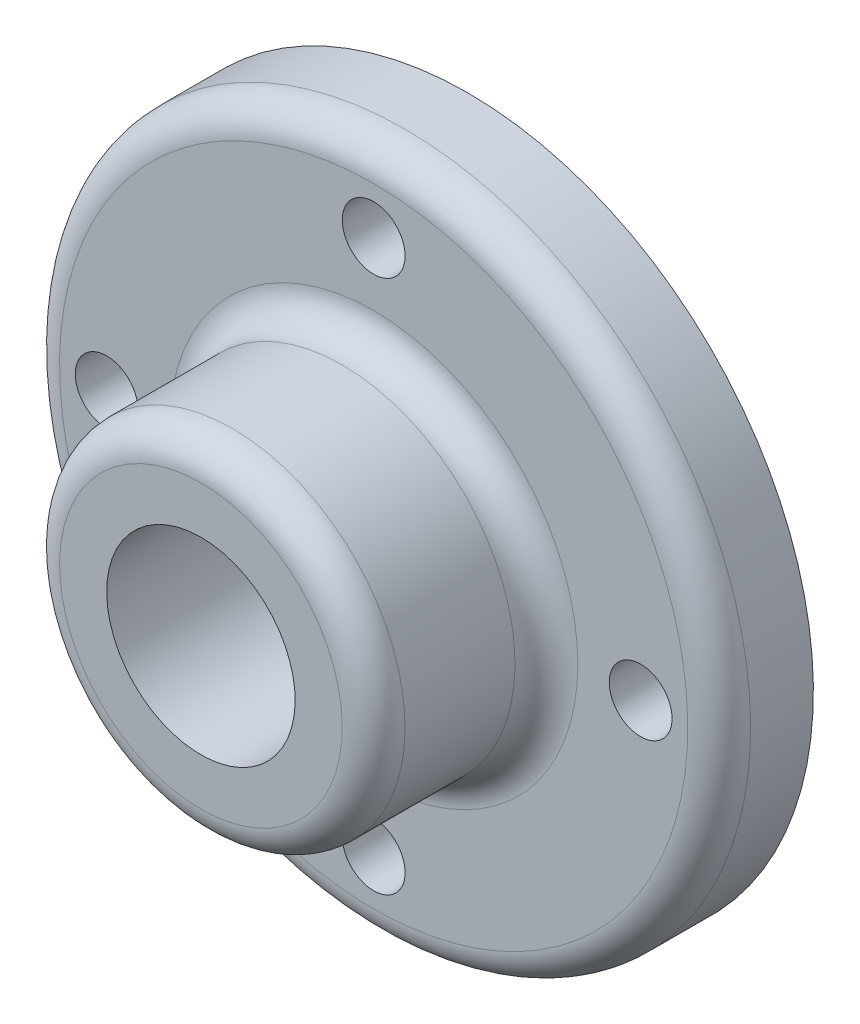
ISO-10303-21;
HEADER;
FILE_DESCRIPTION(('STEP AP214'),'2;1');
FILE_NAME('part.step','',(''),(''),'','','');
FILE_SCHEMA(('AUTOMOTIVE_DESIGN { 1 0 10303 214 1 1 1 1 }'));
ENDSEC;
DATA;
#1=APPLICATION_CONTEXT('core data for automotive mechanical design processes');
#2=APPLICATION_PROTOCOL_DEFINITION('international standard','automotive_design',2000,#1);
#3=PRODUCT_CONTEXT('',#1,'mechanical');
#4=PRODUCT('Part','Part','',(#3));
#5=PRODUCT_RELATED_PRODUCT_CATEGORY('part','',(#4));
#6=PRODUCT_DEFINITION_FORMATION('','',#4);
#7=PRODUCT_DEFINITION_CONTEXT('part definition',#1,'design');
#8=PRODUCT_DEFINITION('design','',#6,#7);
#9=PRODUCT_DEFINITION_SHAPE('','',#8);
#10=(LENGTH_UNIT() NAMED_UNIT(*) SI_UNIT(.MILLI.,.METRE.));
#11=(NAMED_UNIT(*) PLANE_ANGLE_UNIT() SI_UNIT($,.RADIAN.));
#12=(NAMED_UNIT(*) SI_UNIT($,.STERADIAN.) SOLID_ANGLE_UNIT());
#13=UNCERTAINTY_MEASURE_WITH_UNIT(LENGTH_MEASURE(1.E-05),#10,'distance_accuracy_value','');
#14=(GEOMETRIC_REPRESENTATION_CONTEXT(3) GLOBAL_UNCERTAINTY_ASSIGNED_CONTEXT((#13)) GLOBAL_UNIT_ASSIGNED_CONTEXT((#10,
#11,#12)) REPRESENTATION_CONTEXT('',''));
#15=CARTESIAN_POINT('',(0.,0.,0.));
#16=DIRECTION('',(0.,0.,1.));
#17=DIRECTION('',(1.,0.,0.));
#18=AXIS2_PLACEMENT_3D('',#15,#16,#17);
#19=CARTESIAN_POINT('',(0.,-19.05,-1.33025516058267E-13));
#20=DIRECTION('',(0.,0.,1.));
#21=DIRECTION('',(0.,-1.,0.));
#22=AXIS2_PLACEMENT_3D('',#19,#20,#21);
#23=PLANE('',#22);
#24=CARTESIAN_POINT('',(5.65362541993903E-13,-53.975,-1.84227633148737E-12));
#25=DIRECTION('',(0.,0.,1.));
#26=DIRECTION('',(0.,-1.,0.));
#27=AXIS2_PLACEMENT_3D('',#24,#25,#26);
#28=CIRCLE('',#27,6.35);
#29=CARTESIAN_POINT('',(6.31875261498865E-13,-60.325,-1.88661817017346E-12));
#30=VERTEX_POINT('',#29);
#31=EDGE_CURVE('E79',#30,#30,#28,.T.);
#32=ORIENTED_EDGE('',*,*,#31,.T.);
#33=EDGE_LOOP('',(#32));
#34=FACE_BOUND('',#33,.T.);
#35=CARTESIAN_POINT('',(-53.975,-3.76909836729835E-13,-1.46410661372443E-12));
#36=DIRECTION('',(0.,0.,1.));
#37=DIRECTION('',(-1.,0.,0.));
#38=AXIS2_PLACEMENT_3D('',#35,#36,#37);
#39=CIRCLE('',#38,6.35);
#40=CARTESIAN_POINT('',(-60.325,-4.21251649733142E-13,-1.46410661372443E-12));
#41=VERTEX_POINT('',#40);
#42=EDGE_CURVE('E73',#41,#41,#39,.T.);
#43=ORIENTED_EDGE('',*,*,#42,.T.);
#44=EDGE_LOOP('',(#43));
#45=FACE_BOUND('',#44,.T.);
#46=CARTESIAN_POINT('',(-1.88457131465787E-13,53.975,-1.08940634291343E-12));
#47=DIRECTION('',(0.,0.,1.));
#48=DIRECTION('',(0.,1.,0.));
#49=AXIS2_PLACEMENT_3D('',#46,#47,#48);
#50=CIRCLE('',#49,6.35);
#51=CARTESIAN_POINT('',(-2.10628037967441E-13,60.325,-1.04506450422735E-12));
#52=VERTEX_POINT('',#51);
#53=EDGE_CURVE('E67',#52,#52,#50,.T.);
#54=ORIENTED_EDGE('',*,*,#53,.T.);
#55=EDGE_LOOP('',(#54));
#56=FACE_BOUND('',#55,.T.);
#57=CARTESIAN_POINT('',(53.975,0.,-4.8919202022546E-13));
#58=DIRECTION('',(0.,0.,1.));
#59=DIRECTION('',(1.,0.,0.));
#60=AXIS2_PLACEMENT_3D('',#57,#58,#59);
#61=CIRCLE('',#60,6.35);
#62=CARTESIAN_POINT('',(60.325,0.,-4.8919202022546E-13));
#63=VERTEX_POINT('',#62);
#64=EDGE_CURVE('E63',#63,#63,#61,.T.);
#65=ORIENTED_EDGE('',*,*,#64,.T.);
#66=EDGE_LOOP('',(#65));
#67=FACE_BOUND('',#66,.T.);
#68=CARTESIAN_POINT('',(0.,0.,0.));
#69=DIRECTION('',(0.,0.,-1.));
#70=DIRECTION('',(0.,1.,0.));
#71=AXIS2_PLACEMENT_3D('',#68,#69,#70);
#72=CIRCLE('',#71,19.05);
#73=CARTESIAN_POINT('',(0.,19.05,1.33025516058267E-13));
#74=VERTEX_POINT('',#73);
#75=EDGE_CURVE('E10',#74,#74,#72,.T.);
#76=ORIENTED_EDGE('',*,*,#75,.F.);
#77=EDGE_LOOP('',(#76));
#78=FACE_BOUND('',#77,.T.);
#79=CARTESIAN_POINT('',(0.,0.,0.));
#80=DIRECTION('',(0.,0.,-1.));
#81=DIRECTION('',(0.,1.,0.));
#82=AXIS2_PLACEMENT_3D('',#79,#80,#81);
#83=CIRCLE('',#82,69.85);
#84=CARTESIAN_POINT('',(0.,69.85,4.87760225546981E-13));
#85=VERTEX_POINT('',#84);
#86=EDGE_CURVE('E60',#85,#85,#83,.T.);
#87=ORIENTED_EDGE('',*,*,#86,.T.);
#88=EDGE_LOOP('',(#87));
#89=FACE_BOUND('',#88,.T.);
#90=ADVANCED_FACE('F29',(#34,#45,#56,#67,#78,#89),#23,.F.);
#91=CARTESIAN_POINT('',(0.,0.,0.));
#92=DIRECTION('',(0.,0.,-1.));
#93=DIRECTION('',(0.,1.,0.));
#94=AXIS2_PLACEMENT_3D('',#91,#92,#93);
#95=CYLINDRICAL_SURFACE('',#94,19.05);
#96=CARTESIAN_POINT('',(0.,-3.76905628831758E-13,53.975));
#97=DIRECTION('',(0.,0.,-1.));
#98=DIRECTION('',(0.,1.,0.));
#99=AXIS2_PLACEMENT_3D('',#96,#97,#98);
#100=CIRCLE('',#99,19.05);
#101=CARTESIAN_POINT('',(0.,19.0499999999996,53.9750000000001));
#102=VERTEX_POINT('',#101);
#103=EDGE_CURVE('E35',#102,#102,#100,.T.);
#104=ORIENTED_EDGE('',*,*,#103,.F.);
#105=EDGE_LOOP('',(#104));
#106=FACE_BOUND('',#105,.T.);
#107=ORIENTED_EDGE('',*,*,#75,.T.);
#108=EDGE_LOOP('',(#107));
#109=FACE_BOUND('',#108,.T.);
#110=ADVANCED_FACE('F132',(#106,#109),#95,.F.);
#111=CARTESIAN_POINT('',(0.,-28.5750000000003,53.9749999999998));
#112=DIRECTION('',(0.,0.,-1.));
#113=DIRECTION('',(0.,1.,0.));
#114=AXIS2_PLACEMENT_3D('',#111,#112,#113);
#115=PLANE('',#114);
#116=CARTESIAN_POINT('',(0.,-3.76905628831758E-13,53.975));
#117=DIRECTION('',(0.,0.,-1.));
#118=DIRECTION('',(0.,1.,0.));
#119=AXIS2_PLACEMENT_3D('',#116,#117,#118);
#120=CIRCLE('',#119,28.575);
#121=CARTESIAN_POINT('',(0.,28.5749999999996,53.9750000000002));
#122=VERTEX_POINT('',#121);
#123=EDGE_CURVE('E39',#122,#122,#120,.T.);
#124=ORIENTED_EDGE('',*,*,#123,.F.);
#125=EDGE_LOOP('',(#124));
#126=FACE_BOUND('',#125,.T.);
#127=ORIENTED_EDGE('',*,*,#103,.T.);
#128=EDGE_LOOP('',(#127));
#129=FACE_BOUND('',#128,.T.);
#130=ADVANCED_FACE('F127',(#126,#129),#115,.F.);
#131=CARTESIAN_POINT('',(0.,-3.33066907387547E-13,47.625));
#132=DIRECTION('',(0.,0.,-1.));
#133=DIRECTION('',(0.,1.,0.));
#134=AXIS2_PLACEMENT_3D('',#131,#132,#133);
#135=TOROIDAL_SURFACE('',#134,28.575,6.35);
#136=CARTESIAN_POINT('',(0.,-3.32563790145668E-13,47.625));
#137=DIRECTION('',(0.,0.,-1.));
#138=DIRECTION('',(0.,1.,0.));
#139=AXIS2_PLACEMENT_3D('',#136,#137,#138);
#140=CIRCLE('',#139,34.925);
#141=CARTESIAN_POINT('',(0.,34.9249999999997,47.6250000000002));
#142=VERTEX_POINT('',#141);
#143=EDGE_CURVE('E43',#142,#142,#140,.T.);
#144=ORIENTED_EDGE('',*,*,#143,.F.);
#145=EDGE_LOOP('',(#144));
#146=FACE_BOUND('',#145,.T.);
#147=ORIENTED_EDGE('',*,*,#123,.T.);
#148=EDGE_LOOP('',(#147));
#149=FACE_BOUND('',#148,.T.);
#150=ADVANCED_FACE('F121',(#146,#149),#135,.T.);
#151=CARTESIAN_POINT('',(0.,0.,0.));
#152=DIRECTION('',(0.,0.,-1.));
#153=DIRECTION('',(0.,1.,0.));
#154=AXIS2_PLACEMENT_3D('',#151,#152,#153);
#155=CYLINDRICAL_SURFACE('',#154,34.925);
#156=CARTESIAN_POINT('',(0.,-1.77367354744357E-13,25.4));
#157=DIRECTION('',(0.,0.,-1.));
#158=DIRECTION('',(0.,1.,0.));
#159=AXIS2_PLACEMENT_3D('',#156,#157,#158);
#160=CIRCLE('',#159,34.925);
#161=CARTESIAN_POINT('',(0.,34.9249999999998,25.4000000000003));
#162=VERTEX_POINT('',#161);
#163=EDGE_CURVE('E48',#162,#162,#160,.T.);
#164=ORIENTED_EDGE('',*,*,#163,.F.);
#165=EDGE_LOOP('',(#164));
#166=FACE_BOUND('',#165,.T.);
#167=ORIENTED_EDGE('',*,*,#143,.T.);
#168=EDGE_LOOP('',(#167));
#169=FACE_BOUND('',#168,.T.);
#170=ADVANCED_FACE('F115',(#166,#169),#155,.T.);
#171=CARTESIAN_POINT('',(0.,-1.80411241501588E-13,25.4));
#172=DIRECTION('',(0.,0.,-1.));
#173=DIRECTION('',(0.,1.,0.));
#174=AXIS2_PLACEMENT_3D('',#171,#172,#173);
#175=TOROIDAL_SURFACE('',#174,41.275,6.35);
#176=CARTESIAN_POINT('',(0.,-1.33025516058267E-13,19.05));
#177=DIRECTION('',(0.,0.,-1.));
#178=DIRECTION('',(0.,1.,0.));
#179=AXIS2_PLACEMENT_3D('',#176,#177,#178);
#180=CIRCLE('',#179,41.275);
#181=CARTESIAN_POINT('',(0.,41.2749999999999,19.0500000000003));
#182=VERTEX_POINT('',#181);
#183=EDGE_CURVE('E51',#182,#182,#180,.T.);
#184=ORIENTED_EDGE('',*,*,#183,.F.);
#185=EDGE_LOOP('',(#184));
#186=FACE_BOUND('',#185,.T.);
#187=ORIENTED_EDGE('',*,*,#163,.T.);
#188=EDGE_LOOP('',(#187));
#189=FACE_BOUND('',#188,.T.);
#190=ADVANCED_FACE('F101',(#186,#189),#175,.F.);
#191=CARTESIAN_POINT('',(0.,-63.5000000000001,19.0499999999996));
#192=DIRECTION('',(0.,0.,-1.));
#193=DIRECTION('',(0.,1.,0.));
#194=AXIS2_PLACEMENT_3D('',#191,#192,#193);
#195=PLANE('',#194);
#196=CARTESIAN_POINT('',(6.98388058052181E-13,-53.9750000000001,19.0499999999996));
#197=DIRECTION('',(0.,0.,1.));
#198=DIRECTION('',(0.,-1.,0.));
#199=AXIS2_PLACEMENT_3D('',#196,#197,#198);
#200=CIRCLE('',#199,6.35);
#201=CARTESIAN_POINT('',(7.64900777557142E-13,-60.3250000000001,19.0499999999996));
#202=VERTEX_POINT('',#201);
#203=EDGE_CURVE('E82',#202,#202,#200,.T.);
#204=ORIENTED_EDGE('',*,*,#203,.F.);
#205=EDGE_LOOP('',(#204));
#206=FACE_BOUND('',#205,.T.);
#207=CARTESIAN_POINT('',(-53.975,-6.4296086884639E-13,19.05));
#208=DIRECTION('',(0.,0.,1.));
#209=DIRECTION('',(-1.,0.,0.));
#210=AXIS2_PLACEMENT_3D('',#207,#208,#209);
#211=CIRCLE('',#210,6.35);
#212=CARTESIAN_POINT('',(-60.325,-6.87302681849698E-13,19.05));
#213=VERTEX_POINT('',#212);
#214=EDGE_CURVE('E76',#213,#213,#211,.T.);
#215=ORIENTED_EDGE('',*,*,#214,.F.);
#216=EDGE_LOOP('',(#215));
#217=FACE_BOUND('',#216,.T.);
#218=CARTESIAN_POINT('',(-3.21482647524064E-13,53.9749999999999,19.0500000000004));
#219=DIRECTION('',(0.,0.,1.));
#220=DIRECTION('',(0.,1.,0.));
#221=AXIS2_PLACEMENT_3D('',#218,#219,#220);
#222=CIRCLE('',#221,6.35);
#223=CARTESIAN_POINT('',(-3.43653554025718E-13,60.3249999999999,19.0500000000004));
#224=VERTEX_POINT('',#223);
#225=EDGE_CURVE('E70',#224,#224,#222,.T.);
#226=ORIENTED_EDGE('',*,*,#225,.F.);
#227=EDGE_LOOP('',(#226));
#228=FACE_BOUND('',#227,.T.);
#229=CARTESIAN_POINT('',(53.975,0.,19.05));
#230=DIRECTION('',(0.,0.,1.));
#231=DIRECTION('',(1.,0.,0.));
#232=AXIS2_PLACEMENT_3D('',#229,#230,#231);
#233=CIRCLE('',#232,6.35);
#234=CARTESIAN_POINT('',(60.325,0.,19.05));
#235=VERTEX_POINT('',#234);
#236=EDGE_CURVE('E64',#235,#235,#233,.T.);
#237=ORIENTED_EDGE('',*,*,#236,.F.);
#238=EDGE_LOOP('',(#237));
#239=FACE_BOUND('',#238,.T.);
#240=CARTESIAN_POINT('',(0.,-1.33025516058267E-13,19.05));
#241=DIRECTION('',(0.,0.,-1.));
#242=DIRECTION('',(0.,1.,0.));
#243=AXIS2_PLACEMENT_3D('',#240,#241,#242);
#244=CIRCLE('',#243,63.4999999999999);
#245=CARTESIAN_POINT('',(0.,63.4999999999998,19.0500000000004));
#246=VERTEX_POINT('',#245);
#247=EDGE_CURVE('E54',#246,#246,#244,.T.);
#248=ORIENTED_EDGE('',*,*,#247,.F.);
#249=EDGE_LOOP('',(#248));
#250=FACE_BOUND('',#249,.T.);
#251=ORIENTED_EDGE('',*,*,#183,.T.);
#252=EDGE_LOOP('',(#251));
#253=FACE_BOUND('',#252,.T.);
#254=ADVANCED_FACE('F97',(#206,#217,#228,#239,#250,#253),#195,.F.);
#255=CARTESIAN_POINT('',(0.,0.,12.7));
#256=DIRECTION('',(0.,0.,-1.));
#257=DIRECTION('',(0.,1.,0.));
#258=AXIS2_PLACEMENT_3D('',#255,#256,#257);
#259=TOROIDAL_SURFACE('',#258,63.5,6.35);
#260=CARTESIAN_POINT('',(0.,0.,12.7));
#261=DIRECTION('',(0.,0.,-1.));
#262=DIRECTION('',(0.,1.,0.));
#263=AXIS2_PLACEMENT_3D('',#260,#261,#262);
#264=CIRCLE('',#263,69.85);
#265=CARTESIAN_POINT('',(0.,69.8499999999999,12.7000000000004));
#266=VERTEX_POINT('',#265);
#267=EDGE_CURVE('E57',#266,#266,#264,.T.);
#268=ORIENTED_EDGE('',*,*,#267,.F.);
#269=EDGE_LOOP('',(#268));
#270=FACE_BOUND('',#269,.T.);
#271=ORIENTED_EDGE('',*,*,#247,.T.);
#272=EDGE_LOOP('',(#271));
#273=FACE_BOUND('',#272,.T.);
#274=ADVANCED_FACE('F100',(#270,#273),#259,.T.);
#275=CARTESIAN_POINT('',(0.,0.,0.));
#276=DIRECTION('',(0.,0.,-1.));
#277=DIRECTION('',(0.,1.,0.));
#278=AXIS2_PLACEMENT_3D('',#275,#276,#277);
#279=CYLINDRICAL_SURFACE('',#278,69.85);
#280=ORIENTED_EDGE('',*,*,#86,.F.);
#281=EDGE_LOOP('',(#280));
#282=FACE_BOUND('',#281,.T.);
#283=ORIENTED_EDGE('',*,*,#267,.T.);
#284=EDGE_LOOP('',(#283));
#285=FACE_BOUND('',#284,.T.);
#286=ADVANCED_FACE('F179',(#282,#285),#279,.T.);
#287=CARTESIAN_POINT('',(53.975,0.,-4.8919202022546E-13));
#288=DIRECTION('',(0.,0.,1.));
#289=DIRECTION('',(1.,0.,0.));
#290=AXIS2_PLACEMENT_3D('',#287,#288,#289);
#291=CYLINDRICAL_SURFACE('',#290,6.35);
#292=ORIENTED_EDGE('',*,*,#64,.F.);
#293=EDGE_LOOP('',(#292));
#294=FACE_BOUND('',#293,.T.);
#295=ORIENTED_EDGE('',*,*,#236,.T.);
#296=EDGE_LOOP('',(#295));
#297=FACE_BOUND('',#296,.T.);
#298=ADVANCED_FACE('F188',(#294,#297),#291,.F.);
#299=CARTESIAN_POINT('',(-1.88457131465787E-13,53.975,-1.08940634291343E-12));
#300=DIRECTION('',(0.,0.,1.));
#301=DIRECTION('',(0.,-1.,0.));
#302=AXIS2_PLACEMENT_3D('',#299,#300,#301);
#303=CYLINDRICAL_SURFACE('',#302,6.35);
#304=ORIENTED_EDGE('',*,*,#53,.F.);
#305=EDGE_LOOP('',(#304));
#306=FACE_BOUND('',#305,.T.);
#307=ORIENTED_EDGE('',*,*,#225,.T.);
#308=EDGE_LOOP('',(#307));
#309=FACE_BOUND('',#308,.T.);
#310=ADVANCED_FACE('F197',(#306,#309),#303,.F.);
#311=CARTESIAN_POINT('',(-53.975,-3.76909836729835E-13,-1.46410661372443E-12));
#312=DIRECTION('',(0.,0.,1.));
#313=DIRECTION('',(0.,-1.,0.));
#314=AXIS2_PLACEMENT_3D('',#311,#312,#313);
#315=CYLINDRICAL_SURFACE('',#314,6.35);
#316=ORIENTED_EDGE('',*,*,#42,.F.);
#317=EDGE_LOOP('',(#316));
#318=FACE_BOUND('',#317,.T.);
#319=ORIENTED_EDGE('',*,*,#214,.T.);
#320=EDGE_LOOP('',(#319));
#321=FACE_BOUND('',#320,.T.);
#322=ADVANCED_FACE('F93',(#318,#321),#315,.F.);
#323=CARTESIAN_POINT('',(5.65362541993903E-13,-53.975,-1.84227633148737E-12));
#324=DIRECTION('',(0.,0.,1.));
#325=DIRECTION('',(1.,0.,0.));
#326=AXIS2_PLACEMENT_3D('',#323,#324,#325);
#327=CYLINDRICAL_SURFACE('',#326,6.35);
#328=ORIENTED_EDGE('',*,*,#31,.F.);
#329=EDGE_LOOP('',(#328));
#330=FACE_BOUND('',#329,.T.);
#331=ORIENTED_EDGE('',*,*,#203,.T.);
#332=EDGE_LOOP('',(#331));
#333=FACE_BOUND('',#332,.T.);
#334=ADVANCED_FACE('F90',(#330,#333),#327,.F.);
#335=CLOSED_SHELL('',(#90,#110,#130,#150,#170,#190,#254,#274,#286,#298,#310,#322,#334));
#336=MANIFOLD_SOLID_BREP('B2',#335);
#337=ADVANCED_BREP_SHAPE_REPRESENTATION('',(#18,#336),#14);
#338=SHAPE_DEFINITION_REPRESENTATION(#9,#337);
ENDSEC;
END-ISO-10303-21;
